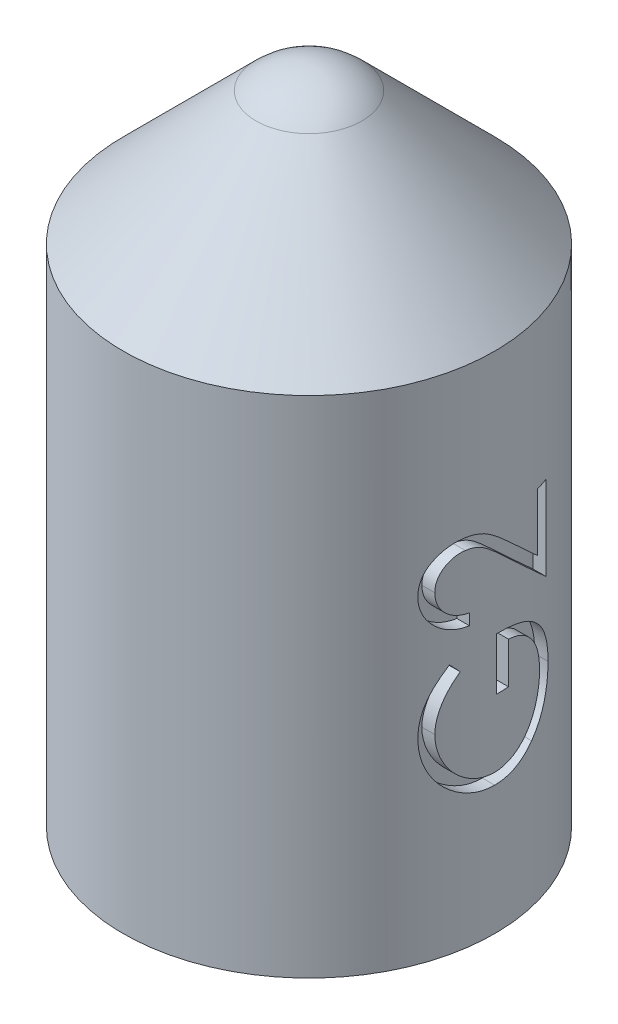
from build123d import *

# Parameters (mm, degrees)
ENL_V_MAT_EXTRU_1_REACH      = 8.442
ENL_V_MAT_EXTRU_1_END_RADIUS = 1.4
ENL_V_MAT_EXTRU_2_REACH      = 8.442
ENL_V_MAT_EXTRU_2_END_RADIUS = 1.4


with BuildPart() as part:
    # Esquisse1 → R_volution1 (revolve)
    with BuildSketch(Plane.XY):
        with BuildLine():
            Line((-1.5, 4.25), (-1.5, 0.17544468))
            ThreePointArc((-1.5, 0.17544468), (-0.755112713, 0.044010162), (0, 0))
            Line((0, 0), (0, 5.5))
            ThreePointArc((0, 5.5), (-0.230969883, 5.454057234), (-0.426776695, 5.323223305))
            Line((-0.426776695, 5.323223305), (-1.5, 4.25))
        make_face()
    revolve(axis=Axis((0, 0, 0), (0, 1, 0)))

    # Enl_v. mat.-Extru.1: up to this cylinder (the profile starts outside it)
    enl_v_mat_extru_1_end = Plane(origin=(0, 2.3089885, 0), z_dir=(0, -1, 0)) * Cylinder(ENL_V_MAT_EXTRU_1_END_RADIUS, 20.995511, mode=Mode.PRIVATE)
    # Esquisse2 → Enl_v. mat.-Extru.1 (cut, up to the surface)
    with BuildSketch(Plane(origin=(1.5, 0, 0), x_dir=(0, 0, -1), z_dir=(1, 0, 0)), mode=Mode.PRIVATE) as enl_v_mat_extru_1_sk1:
        with BuildLine():
            Line((-0.192307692, 2.509615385), (-0.192307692, 2.419871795))
            add(Edge.make_bspline(
                [(-0.192307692, 2.419871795), (-0.20421366, 2.420456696), (-0.227596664, 2.421605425), (-0.261689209, 2.426984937), (-0.294276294, 2.43468233), (-0.32509627, 2.445565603), (-0.354421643, 2.459081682), (-0.382135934, 2.475290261), (-0.408133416, 2.494488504), (-0.432173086, 2.516261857), (-0.454226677, 2.53991004), (-0.473271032, 2.565426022), (-0.489361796, 2.592238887), (-0.502813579, 2.620267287), (-0.512910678, 2.649827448), (-0.520402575, 2.680651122), (-0.524910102, 2.712873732), (-0.525394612, 2.734828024), (-0.525641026, 2.74599359)],
                knots=[0, 0, 0, 0, 1.10065271, 2.161652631, 3.183658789, 4.190468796, 5.17591951, 6.163126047, 7.15150782, 8.156236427, 9.156009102, 10.134482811, 11.092018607, 12.041330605, 13.001268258, 13.972401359, 14.968799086, 16, 16, 16, 16], degree=3))
            add(Edge.make_bspline(
                [(-0.525641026, 2.74599359), (-0.525386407, 2.756959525), (-0.52488609, 2.778507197), (-0.520524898, 2.809942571), (-0.51384176, 2.839939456), (-0.503938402, 2.868157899), (-0.491511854, 2.8948875), (-0.476057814, 2.919797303), (-0.458307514, 2.943489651), (-0.437370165, 2.964801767), (-0.415029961, 2.984379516), (-0.391170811, 3.001254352), (-0.366499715, 3.015787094), (-0.340823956, 3.027681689), (-0.314059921, 3.036698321), (-0.286464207, 3.043378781), (-0.257718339, 3.047197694), (-0.238258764, 3.04778058), (-0.228365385, 3.048076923)],
                knots=[0, 0, 0, 0, 1.111674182, 2.184400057, 3.212814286, 4.223731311, 5.211378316, 6.196328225, 7.191884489, 8.207283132, 9.220262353, 10.201199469, 11.166417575, 12.120932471, 13.06540007, 14.026332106, 14.996573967, 16, 16, 16, 16], degree=3))
            add(Edge.make_bspline(
                [(-0.228365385, 3.048076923), (-0.214437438, 3.047593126), (-0.18682596, 3.046634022), (-0.146250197, 3.038430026), (-0.106938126, 3.025616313), (-0.075297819, 3.010189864), (-0.049804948, 2.994623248), (-0.028805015, 2.980609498), (-0.006199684, 2.964110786), (0.018102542, 2.945268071), (0.043783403, 2.923756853), (0.071366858, 2.900135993), (0.100342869, 2.873795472), (0.120146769, 2.855324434), (0.130408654, 2.845753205)],
                knots=[0, 0, 0, 0, 1.184416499, 2.348048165, 3.509039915, 4.696071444, 5.333504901, 6.05069495, 6.844171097, 7.714965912, 8.667477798, 9.695072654, 10.805644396, 12, 12, 12, 12], degree=3))
            Line((0.130408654, 2.845753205), (0.397435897, 2.595552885))
            Line((0.397435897, 2.595552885), (0.397435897, 3.060897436))
            Line((0.397435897, 3.060897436), (0.5, 3.060897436))
            Line((0.5, 3.060897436), (0.5, 2.381410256))
            Line((0.5, 2.381410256), (0.086137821, 2.769230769))
            add(Edge.make_bspline(
                [(0.086137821, 2.769230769), (0.076281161, 2.778673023), (0.057348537, 2.796809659), (0.029707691, 2.822461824), (0.004064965, 2.845501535), (-0.019531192, 2.866077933), (-0.041425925, 2.883744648), (-0.060910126, 2.899422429), (-0.078839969, 2.911984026), (-0.099623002, 2.925616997), (-0.12499795, 2.938820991), (-0.156007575, 2.950167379), (-0.187929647, 2.957085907), (-0.209501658, 2.95791586), (-0.220352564, 2.958333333)],
                knots=[0, 0, 0, 0, 1.329631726, 2.553950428, 3.673215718, 4.687767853, 5.603093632, 6.413772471, 7.123043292, 7.734684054, 8.834405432, 9.900288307, 10.943827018, 12, 12, 12, 12], degree=3))
            add(Edge.make_bspline(
                [(-0.220352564, 2.958333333), (-0.227175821, 2.958151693), (-0.240623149, 2.957793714), (-0.260339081, 2.954634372), (-0.279357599, 2.949859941), (-0.297737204, 2.943018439), (-0.315293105, 2.933987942), (-0.332046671, 2.922995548), (-0.348243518, 2.910312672), (-0.363430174, 2.895640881), (-0.37733909, 2.879523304), (-0.389660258, 2.862496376), (-0.399957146, 2.84448206), (-0.408398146, 2.825556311), (-0.415019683, 2.805771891), (-0.419607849, 2.785090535), (-0.422488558, 2.763569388), (-0.422878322, 2.748874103), (-0.423076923, 2.741386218)],
                knots=[0, 0, 0, 0, 0.991446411, 1.95395049, 2.89581595, 3.838931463, 4.798493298, 5.75982156, 6.748411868, 7.785213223, 8.824556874, 9.840280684, 10.836137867, 11.835679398, 12.848801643, 13.863922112, 14.911575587, 16, 16, 16, 16], degree=3))
            add(Edge.make_bspline(
                [(-0.423076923, 2.741386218), (-0.422880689, 2.733564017), (-0.422495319, 2.718202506), (-0.419576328, 2.695696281), (-0.415151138, 2.674078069), (-0.40812297, 2.653670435), (-0.39981884, 2.634031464), (-0.389269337, 2.615580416), (-0.377010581, 2.598010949), (-0.362796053, 2.581612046), (-0.346825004, 2.566634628), (-0.329223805, 2.553289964), (-0.310119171, 2.541706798), (-0.289589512, 2.531586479), (-0.267430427, 2.523371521), (-0.243725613, 2.517093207), (-0.218576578, 2.512125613), (-0.201209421, 2.510466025), (-0.192307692, 2.509615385)],
                knots=[0, 0, 0, 0, 1.030878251, 2.024474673, 2.987898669, 3.934362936, 4.864849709, 5.795128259, 6.730474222, 7.685293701, 8.650606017, 9.611896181, 10.591709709, 11.591680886, 12.625074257, 13.701333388, 14.821793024, 16, 16, 16, 16], degree=3))
        make_face()
    enl_v_mat_extru_1_tool1 = extrude(enl_v_mat_extru_1_sk1.sketch, amount=-ENL_V_MAT_EXTRU_1_REACH, mode=Mode.PRIVATE) - enl_v_mat_extru_1_end
    add(enl_v_mat_extru_1_tool1.solids().sort_by_distance((1.5, 2.464744, 0.204611))[0], mode=Mode.SUBTRACT)
    # Esquisse2 → Enl_v. mat.-Extru.1 (cut, up to the surface)
    with BuildSketch(Plane(origin=(1.5, 0, 0), x_dir=(0, 0, -1), z_dir=(1, 0, 0)), mode=Mode.PRIVATE) as enl_v_mat_extru_1_sk2:
        with BuildLine():
            Line((-0.329326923, 2.201923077), (-0.256410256, 2.125))
            add(Edge.make_bspline(
                [(-0.256410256, 2.125), (-0.269509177, 2.11108312), (-0.295394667, 2.083581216), (-0.328926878, 2.038666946), (-0.357936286, 1.991993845), (-0.381363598, 1.943486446), (-0.399741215, 1.894416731), (-0.413100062, 1.845628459), (-0.421560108, 1.797437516), (-0.422576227, 1.765390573), (-0.423076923, 1.749599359)],
                knots=[0, 0, 0, 0, 1.089067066, 2.152164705, 3.18986567, 4.218445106, 5.218487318, 6.173592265, 7.100032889, 8, 8, 8, 8], degree=3))
            add(Edge.make_bspline(
                [(-0.423076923, 1.749599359), (-0.42295875, 1.739909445), (-0.42272271, 1.720554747), (-0.419710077, 1.691805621), (-0.415377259, 1.66335801), (-0.409108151, 1.635265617), (-0.401162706, 1.607473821), (-0.391224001, 1.580079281), (-0.379636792, 1.55303089), (-0.3662475, 1.526583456), (-0.351539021, 1.500943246), (-0.335239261, 1.476727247), (-0.317871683, 1.453779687), (-0.298997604, 1.432537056), (-0.278802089, 1.412858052), (-0.257648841, 1.394380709), (-0.235121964, 1.377449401), (-0.211314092, 1.36236779), (-0.186779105, 1.348748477), (-0.161725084, 1.336979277), (-0.136384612, 1.326747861), (-0.11056688, 1.318955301), (-0.084538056, 1.312355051), (-0.058161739, 1.307760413), (-0.031369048, 1.305161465), (-0.013426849, 1.304712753), (-0.004407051, 1.304487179)],
                knots=[0, 0, 0, 0, 1.028150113, 2.053633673, 3.06513288, 4.081487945, 5.106702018, 6.131327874, 7.172780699, 8.228344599, 9.276313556, 10.308389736, 11.324843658, 12.329040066, 13.321460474, 14.316307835, 15.308626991, 16.309440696, 17.305625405, 18.28535951, 19.246194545, 20.203493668, 21.145557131, 22.095268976, 23.042464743, 24, 24, 24, 24], degree=3))
            add(Edge.make_bspline(
                [(-0.004407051, 1.304487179), (0.004813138, 1.304703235), (0.023228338, 1.305134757), (0.050713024, 1.307892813), (0.077786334, 1.313022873), (0.104490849, 1.31982623), (0.130879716, 1.328475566), (0.156925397, 1.339101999), (0.18262536, 1.351760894), (0.207724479, 1.366381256), (0.232153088, 1.382526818), (0.255356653, 1.4002843), (0.277065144, 1.419683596), (0.297595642, 1.440369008), (0.316818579, 1.462529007), (0.334502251, 1.486378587), (0.350920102, 1.5115839), (0.365891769, 1.538156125), (0.379265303, 1.565814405), (0.391157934, 1.594173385), (0.400952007, 1.623324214), (0.408934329, 1.653113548), (0.415477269, 1.683505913), (0.41968655, 1.71465557), (0.422741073, 1.746333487), (0.422964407, 1.767687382), (0.423076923, 1.778445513)],
                knots=[0, 0, 0, 0, 0.935915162, 1.869274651, 2.799799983, 3.730201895, 4.664668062, 5.616159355, 6.583070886, 7.570012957, 8.562524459, 9.553461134, 10.53281078, 11.515274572, 12.509912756, 13.507571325, 14.526460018, 15.561318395, 16.601025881, 17.643204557, 18.680545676, 19.719612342, 20.772381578, 21.833430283, 22.908478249, 24, 24, 24, 24], degree=3))
            add(Edge.make_bspline(
                [(0.423076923, 1.778445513), (0.422806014, 1.791410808), (0.422274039, 1.816870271), (0.418129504, 1.854294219), (0.411664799, 1.890240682), (0.402167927, 1.924592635), (0.390147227, 1.957474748), (0.375281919, 1.988765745), (0.357728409, 2.018552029), (0.337842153, 2.046704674), (0.315685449, 2.072554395), (0.291989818, 2.096080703), (0.266448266, 2.116474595), (0.239441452, 2.134345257), (0.21071105, 2.149115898), (0.180416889, 2.161243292), (0.148540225, 2.170538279), (0.126514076, 2.174354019), (0.115384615, 2.176282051)],
                knots=[0, 0, 0, 0, 1.130199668, 2.219330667, 3.279027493, 4.311506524, 5.322739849, 6.327972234, 7.327472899, 8.33386792, 9.329086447, 10.29244429, 11.240784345, 12.174119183, 13.111530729, 14.052100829, 15.015757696, 16, 16, 16, 16], degree=3))
            Line((0.115384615, 2.176282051), (0.115384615, 1.842948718))
            Line((0.115384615, 1.842948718), (0.012820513, 1.842948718))
            Line((0.012820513, 1.842948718), (0.012820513, 2.266025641))
            add(Edge.make_bspline(
                [(0.012820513, 2.266025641), (0.031936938, 2.265538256), (0.069351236, 2.264584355), (0.12391417, 2.257893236), (0.17544894, 2.247088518), (0.224009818, 2.232328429), (0.269527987, 2.213221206), (0.312049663, 2.189971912), (0.351300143, 2.162208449), (0.387599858, 2.130919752), (0.419979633, 2.095805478), (0.448438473, 2.057814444), (0.472410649, 2.016883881), (0.491913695, 1.973052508), (0.507134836, 1.926463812), (0.517926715, 1.87700999), (0.524392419, 1.824758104), (0.525218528, 1.788947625), (0.525641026, 1.770633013)],
                knots=[0, 0, 0, 0, 1.140356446, 2.231883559, 3.274166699, 4.278491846, 5.25512956, 6.21435461, 7.1637429, 8.11826594, 9.068280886, 10.0076534, 10.945064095, 11.891975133, 12.864533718, 13.863980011, 14.907571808, 16, 16, 16, 16], degree=3))
            add(Edge.make_bspline(
                [(0.525641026, 1.770633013), (0.52547842, 1.759344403), (0.525157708, 1.737079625), (0.522878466, 1.704196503), (0.51936973, 1.67222004), (0.514071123, 1.641154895), (0.507581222, 1.610886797), (0.499270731, 1.581566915), (0.489651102, 1.553083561), (0.478709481, 1.525392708), (0.466031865, 1.498745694), (0.451943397, 1.473023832), (0.436516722, 1.448084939), (0.419485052, 1.424098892), (0.400975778, 1.400940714), (0.380951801, 1.378759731), (0.359474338, 1.357431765), (0.344223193, 1.344071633), (0.336538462, 1.337339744)],
                knots=[0, 0, 0, 0, 1.107784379, 2.184907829, 3.233506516, 4.263428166, 5.276301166, 6.270063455, 7.25232949, 8.225834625, 9.190232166, 10.146266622, 11.1027726, 12.066435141, 13.031522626, 14.010570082, 14.99756817, 16, 16, 16, 16], degree=3))
            add(Edge.make_bspline(
                [(0.336538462, 1.337339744), (0.324346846, 1.327572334), (0.300165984, 1.308199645), (0.261423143, 1.283263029), (0.221308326, 1.262005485), (0.179709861, 1.244757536), (0.136666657, 1.231289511), (0.092233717, 1.221630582), (0.046353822, 1.215971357), (0.015306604, 1.21515606), (-0.000400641, 1.21474359)],
                knots=[0, 0, 0, 0, 1.023165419, 2.029347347, 3.013907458, 3.994755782, 4.975994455, 5.96558838, 6.970761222, 8, 8, 8, 8], degree=3))
            add(Edge.make_bspline(
                [(-0.000400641, 1.21474359), (-0.012162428, 1.214895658), (-0.035536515, 1.215197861), (-0.070238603, 1.218862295), (-0.104324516, 1.224119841), (-0.137766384, 1.231847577), (-0.170586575, 1.241589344), (-0.202800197, 1.253747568), (-0.234426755, 1.267902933), (-0.265246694, 1.284357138), (-0.294858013, 1.302662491), (-0.323115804, 1.322550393), (-0.349562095, 1.344174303), (-0.374258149, 1.367597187), (-0.397569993, 1.392346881), (-0.419010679, 1.418942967), (-0.438915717, 1.446982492), (-0.456902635, 1.476682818), (-0.473064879, 1.507575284), (-0.487232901, 1.539592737), (-0.498942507, 1.572723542), (-0.508877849, 1.606719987), (-0.516225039, 1.641839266), (-0.52155325, 1.677826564), (-0.525199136, 1.714869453), (-0.525492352, 1.739908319), (-0.525641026, 1.752604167)],
                knots=[0, 0, 0, 0, 1.00895651, 2.005089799, 2.991467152, 3.967318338, 4.948153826, 5.927364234, 6.919980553, 7.91976625, 8.923240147, 9.905815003, 10.88314567, 11.851989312, 12.825009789, 13.798721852, 14.781296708, 15.773896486, 16.776076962, 17.771600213, 18.775744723, 19.78957137, 20.808953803, 21.851964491, 22.910847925, 24, 24, 24, 24], degree=3))
            add(Edge.make_bspline(
                [(-0.525641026, 1.752604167), (-0.525475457, 1.762957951), (-0.525147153, 1.783488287), (-0.522871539, 1.814038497), (-0.519264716, 1.844116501), (-0.514342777, 1.873766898), (-0.507638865, 1.902888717), (-0.499616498, 1.931564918), (-0.490275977, 1.959837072), (-0.479136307, 1.987616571), (-0.466492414, 2.015090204), (-0.452260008, 2.04241073), (-0.436195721, 2.069484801), (-0.418251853, 2.096359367), (-0.398736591, 2.123203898), (-0.377091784, 2.149593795), (-0.354170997, 2.176166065), (-0.337690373, 2.193252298), (-0.329326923, 2.201923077)],
                knots=[0, 0, 0, 0, 0.985871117, 1.954866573, 2.915460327, 3.869826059, 4.81536089, 5.759505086, 6.70452669, 7.649098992, 8.607881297, 9.583363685, 10.581137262, 11.603961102, 12.659522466, 13.73993555, 14.853081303, 16, 16, 16, 16], degree=3))
        make_face()
    enl_v_mat_extru_1_tool2 = extrude(enl_v_mat_extru_1_sk2.sketch, amount=-ENL_V_MAT_EXTRU_1_REACH, mode=Mode.PRIVATE) - enl_v_mat_extru_1_end
    add(enl_v_mat_extru_1_tool2.solids().sort_by_distance((1.5, 2.153233, 0.303659))[0], mode=Mode.SUBTRACT)

    # Enl_v. mat.-Extru.2: up to this cylinder (the profile starts outside it)
    enl_v_mat_extru_2_end = Plane(origin=(0, 2.30883, 0), z_dir=(0, -1, 0)) * Cylinder(ENL_V_MAT_EXTRU_2_END_RADIUS, 20.99551, mode=Mode.PRIVATE)
    # Esquisse3 → Enl_v. mat.-Extru.2 (cut, up to the surface)
    with BuildSketch(Plane.ZY.offset(1.5), mode=Mode.PRIVATE) as enl_v_mat_extru_2_sk1:
        with BuildLine():
            Line((-0.192307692, 2.509456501), (-0.192307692, 2.419712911))
            add(Edge.make_bspline(
                [(-0.192307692, 2.419712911), (-0.20421366, 2.420297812), (-0.227596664, 2.421446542), (-0.261689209, 2.426826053), (-0.294276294, 2.434523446), (-0.32509627, 2.445406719), (-0.354421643, 2.458922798), (-0.382135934, 2.475131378), (-0.408133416, 2.494329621), (-0.432173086, 2.516102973), (-0.454226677, 2.539751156), (-0.473271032, 2.565267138), (-0.489361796, 2.592080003), (-0.502813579, 2.620108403), (-0.512910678, 2.649668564), (-0.520402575, 2.680492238), (-0.524910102, 2.712714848), (-0.525394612, 2.73466914), (-0.525641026, 2.745834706)],
                knots=[0, 0, 0, 0, 1.10065271, 2.161652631, 3.183658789, 4.190468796, 5.17591951, 6.163126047, 7.15150782, 8.156236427, 9.156009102, 10.134482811, 11.092018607, 12.041330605, 13.001268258, 13.972401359, 14.968799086, 16, 16, 16, 16], degree=3))
            add(Edge.make_bspline(
                [(-0.525641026, 2.745834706), (-0.525386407, 2.756800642), (-0.52488609, 2.778348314), (-0.520524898, 2.809783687), (-0.51384176, 2.839780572), (-0.503938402, 2.867999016), (-0.491511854, 2.894728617), (-0.476057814, 2.919638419), (-0.458307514, 2.943330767), (-0.437370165, 2.964642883), (-0.415029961, 2.984220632), (-0.391170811, 3.001095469), (-0.366499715, 3.01562821), (-0.340823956, 3.027522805), (-0.314059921, 3.036539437), (-0.286464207, 3.043219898), (-0.257718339, 3.04703881), (-0.238258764, 3.047621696), (-0.228365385, 3.047918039)],
                knots=[0, 0, 0, 0, 1.111674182, 2.184400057, 3.212814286, 4.223731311, 5.211378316, 6.196328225, 7.191884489, 8.207283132, 9.220262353, 10.201199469, 11.166417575, 12.120932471, 13.06540007, 14.026332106, 14.996573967, 16, 16, 16, 16], degree=3))
            add(Edge.make_bspline(
                [(-0.228365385, 3.047918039), (-0.214437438, 3.047434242), (-0.18682596, 3.046475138), (-0.146250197, 3.038271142), (-0.106938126, 3.025457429), (-0.075297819, 3.01003098), (-0.049804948, 2.994464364), (-0.028805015, 2.980450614), (-0.006199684, 2.963951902), (0.018102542, 2.945109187), (0.043783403, 2.92359797), (0.071366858, 2.899977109), (0.100342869, 2.873636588), (0.120146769, 2.85516555), (0.130408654, 2.845594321)],
                knots=[0, 0, 0, 0, 1.184416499, 2.348048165, 3.509039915, 4.696071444, 5.333504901, 6.05069495, 6.844171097, 7.714965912, 8.667477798, 9.695072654, 10.805644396, 12, 12, 12, 12], degree=3))
            Line((0.130408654, 2.845594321), (0.397435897, 2.595394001))
            Line((0.397435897, 2.595394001), (0.397435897, 3.060738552))
            Line((0.397435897, 3.060738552), (0.5, 3.060738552))
            Line((0.5, 3.060738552), (0.5, 2.381251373))
            Line((0.5, 2.381251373), (0.086137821, 2.769071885))
            add(Edge.make_bspline(
                [(0.086137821, 2.769071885), (0.076281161, 2.778514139), (0.057348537, 2.796650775), (0.029707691, 2.82230294), (0.004064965, 2.845342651), (-0.019531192, 2.865919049), (-0.041425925, 2.883585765), (-0.060910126, 2.899263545), (-0.078839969, 2.911825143), (-0.099623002, 2.925458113), (-0.12499795, 2.938662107), (-0.156007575, 2.950008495), (-0.187929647, 2.956927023), (-0.209501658, 2.957756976), (-0.220352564, 2.95817445)],
                knots=[0, 0, 0, 0, 1.329631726, 2.553950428, 3.673215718, 4.687767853, 5.603093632, 6.413772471, 7.123043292, 7.734684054, 8.834405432, 9.900288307, 10.943827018, 12, 12, 12, 12], degree=3))
            add(Edge.make_bspline(
                [(-0.220352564, 2.95817445), (-0.227175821, 2.957992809), (-0.240623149, 2.95763483), (-0.260339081, 2.954475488), (-0.279357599, 2.949701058), (-0.297737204, 2.942859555), (-0.315293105, 2.933829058), (-0.332046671, 2.922836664), (-0.348243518, 2.910153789), (-0.363430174, 2.895481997), (-0.37733909, 2.87936442), (-0.389660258, 2.862337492), (-0.399957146, 2.844323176), (-0.408398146, 2.825397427), (-0.415019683, 2.805613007), (-0.419607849, 2.784931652), (-0.422488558, 2.763410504), (-0.422878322, 2.74871522), (-0.423076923, 2.741227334)],
                knots=[0, 0, 0, 0, 0.991446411, 1.95395049, 2.89581595, 3.838931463, 4.798493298, 5.75982156, 6.748411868, 7.785213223, 8.824556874, 9.840280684, 10.836137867, 11.835679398, 12.848801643, 13.863922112, 14.911575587, 16, 16, 16, 16], degree=3))
            add(Edge.make_bspline(
                [(-0.423076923, 2.741227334), (-0.422880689, 2.733405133), (-0.422495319, 2.718043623), (-0.419576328, 2.695537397), (-0.415151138, 2.673919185), (-0.40812297, 2.653511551), (-0.39981884, 2.63387258), (-0.389269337, 2.615421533), (-0.377010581, 2.597852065), (-0.362796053, 2.581453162), (-0.346825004, 2.566475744), (-0.329223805, 2.553131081), (-0.310119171, 2.541547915), (-0.289589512, 2.531427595), (-0.267430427, 2.523212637), (-0.243725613, 2.516934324), (-0.218576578, 2.511966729), (-0.201209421, 2.510307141), (-0.192307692, 2.509456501)],
                knots=[0, 0, 0, 0, 1.030878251, 2.024474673, 2.987898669, 3.934362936, 4.864849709, 5.795128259, 6.730474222, 7.685293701, 8.650606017, 9.611896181, 10.591709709, 11.591680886, 12.625074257, 13.701333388, 14.821793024, 16, 16, 16, 16], degree=3))
        make_face()
    enl_v_mat_extru_2_tool1 = extrude(enl_v_mat_extru_2_sk1.sketch, amount=-ENL_V_MAT_EXTRU_2_REACH, mode=Mode.PRIVATE) - enl_v_mat_extru_2_end
    add(enl_v_mat_extru_2_tool1.solids().sort_by_distance((-1.5, 2.464585, -0.204611))[0], mode=Mode.SUBTRACT)
    # Esquisse3 → Enl_v. mat.-Extru.2 (cut, up to the surface)
    with BuildSketch(Plane.ZY.offset(1.5), mode=Mode.PRIVATE) as enl_v_mat_extru_2_sk2:
        with BuildLine():
            Line((-0.329326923, 2.201764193), (-0.256410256, 2.124841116))
            add(Edge.make_bspline(
                [(-0.256410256, 2.124841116), (-0.269509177, 2.110924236), (-0.295394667, 2.083422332), (-0.328926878, 2.038508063), (-0.357936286, 1.991834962), (-0.381363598, 1.943327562), (-0.399741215, 1.894257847), (-0.413100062, 1.845469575), (-0.421560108, 1.797278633), (-0.422576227, 1.765231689), (-0.423076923, 1.749440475)],
                knots=[0, 0, 0, 0, 1.089067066, 2.152164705, 3.18986567, 4.218445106, 5.218487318, 6.173592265, 7.100032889, 8, 8, 8, 8], degree=3))
            add(Edge.make_bspline(
                [(-0.423076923, 1.749440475), (-0.42295875, 1.739750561), (-0.42272271, 1.720395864), (-0.419710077, 1.691646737), (-0.415377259, 1.663199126), (-0.409108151, 1.635106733), (-0.401162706, 1.607314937), (-0.391224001, 1.579920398), (-0.379636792, 1.552872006), (-0.3662475, 1.526424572), (-0.351539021, 1.500784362), (-0.335239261, 1.476568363), (-0.317871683, 1.453620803), (-0.298997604, 1.432378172), (-0.278802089, 1.412699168), (-0.257648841, 1.394221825), (-0.235121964, 1.377290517), (-0.211314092, 1.362208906), (-0.186779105, 1.348589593), (-0.161725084, 1.336820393), (-0.136384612, 1.326588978), (-0.11056688, 1.318796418), (-0.084538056, 1.312196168), (-0.058161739, 1.307601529), (-0.031369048, 1.305002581), (-0.013426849, 1.304553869), (-0.004407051, 1.304328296)],
                knots=[0, 0, 0, 0, 1.028150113, 2.053633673, 3.06513288, 4.081487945, 5.106702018, 6.131327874, 7.172780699, 8.228344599, 9.276313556, 10.308389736, 11.324843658, 12.329040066, 13.321460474, 14.316307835, 15.308626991, 16.309440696, 17.305625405, 18.28535951, 19.246194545, 20.203493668, 21.145557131, 22.095268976, 23.042464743, 24, 24, 24, 24], degree=3))
            add(Edge.make_bspline(
                [(-0.004407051, 1.304328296), (0.004813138, 1.304544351), (0.023228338, 1.304975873), (0.050713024, 1.307733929), (0.077786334, 1.312863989), (0.104490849, 1.319667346), (0.130879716, 1.328316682), (0.156925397, 1.338943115), (0.18262536, 1.35160201), (0.207724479, 1.366222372), (0.232153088, 1.382367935), (0.255356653, 1.400125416), (0.277065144, 1.419524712), (0.297595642, 1.440210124), (0.316818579, 1.462370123), (0.334502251, 1.486219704), (0.350920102, 1.511425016), (0.365891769, 1.537997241), (0.379265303, 1.565655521), (0.391157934, 1.594014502), (0.400952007, 1.623165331), (0.408934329, 1.652954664), (0.415477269, 1.683347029), (0.41968655, 1.714496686), (0.422741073, 1.746174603), (0.422964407, 1.767528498), (0.423076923, 1.778286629)],
                knots=[0, 0, 0, 0, 0.935915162, 1.869274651, 2.799799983, 3.730201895, 4.664668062, 5.616159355, 6.583070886, 7.570012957, 8.562524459, 9.553461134, 10.53281078, 11.515274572, 12.509912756, 13.507571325, 14.526460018, 15.561318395, 16.601025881, 17.643204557, 18.680545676, 19.719612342, 20.772381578, 21.833430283, 22.908478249, 24, 24, 24, 24], degree=3))
            add(Edge.make_bspline(
                [(0.423076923, 1.778286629), (0.422806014, 1.791251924), (0.422274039, 1.816711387), (0.418129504, 1.854135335), (0.411664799, 1.890081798), (0.402167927, 1.924433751), (0.390147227, 1.957315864), (0.375281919, 1.988606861), (0.357728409, 2.018393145), (0.337842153, 2.046545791), (0.315685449, 2.072395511), (0.291989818, 2.095921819), (0.266448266, 2.116315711), (0.239441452, 2.134186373), (0.21071105, 2.148957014), (0.180416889, 2.161084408), (0.148540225, 2.170379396), (0.126514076, 2.174195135), (0.115384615, 2.176123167)],
                knots=[0, 0, 0, 0, 1.130199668, 2.219330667, 3.279027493, 4.311506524, 5.322739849, 6.327972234, 7.327472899, 8.33386792, 9.329086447, 10.29244429, 11.240784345, 12.174119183, 13.111530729, 14.052100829, 15.015757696, 16, 16, 16, 16], degree=3))
            Line((0.115384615, 2.176123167), (0.115384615, 1.842789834))
            Line((0.115384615, 1.842789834), (0.012820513, 1.842789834))
            Line((0.012820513, 1.842789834), (0.012820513, 2.265866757))
            add(Edge.make_bspline(
                [(0.012820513, 2.265866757), (0.031936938, 2.265379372), (0.069351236, 2.264425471), (0.12391417, 2.257734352), (0.17544894, 2.246929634), (0.224009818, 2.232169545), (0.269527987, 2.213062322), (0.312049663, 2.189813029), (0.351300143, 2.162049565), (0.387599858, 2.130760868), (0.419979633, 2.095646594), (0.448438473, 2.05765556), (0.472410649, 2.016724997), (0.491913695, 1.972893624), (0.507134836, 1.926304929), (0.517926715, 1.876851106), (0.524392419, 1.82459922), (0.525218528, 1.788788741), (0.525641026, 1.770474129)],
                knots=[0, 0, 0, 0, 1.140356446, 2.231883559, 3.274166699, 4.278491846, 5.25512956, 6.21435461, 7.1637429, 8.11826594, 9.068280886, 10.0076534, 10.945064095, 11.891975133, 12.864533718, 13.863980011, 14.907571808, 16, 16, 16, 16], degree=3))
            add(Edge.make_bspline(
                [(0.525641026, 1.770474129), (0.52547842, 1.759185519), (0.525157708, 1.736920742), (0.522878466, 1.704037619), (0.51936973, 1.672061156), (0.514071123, 1.640996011), (0.507581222, 1.610727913), (0.499270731, 1.581408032), (0.489651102, 1.552924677), (0.478709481, 1.525233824), (0.466031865, 1.49858681), (0.451943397, 1.472864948), (0.436516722, 1.447926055), (0.419485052, 1.423940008), (0.400975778, 1.400781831), (0.380951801, 1.378600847), (0.359474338, 1.357272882), (0.344223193, 1.343912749), (0.336538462, 1.33718086)],
                knots=[0, 0, 0, 0, 1.107784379, 2.184907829, 3.233506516, 4.263428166, 5.276301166, 6.270063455, 7.25232949, 8.225834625, 9.190232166, 10.146266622, 11.1027726, 12.066435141, 13.031522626, 14.010570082, 14.99756817, 16, 16, 16, 16], degree=3))
            add(Edge.make_bspline(
                [(0.336538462, 1.33718086), (0.324346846, 1.327413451), (0.300165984, 1.308040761), (0.261423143, 1.283104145), (0.221308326, 1.261846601), (0.179709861, 1.244598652), (0.136666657, 1.231130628), (0.092233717, 1.221471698), (0.046353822, 1.215812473), (0.015306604, 1.214997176), (-0.000400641, 1.214584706)],
                knots=[0, 0, 0, 0, 1.023165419, 2.029347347, 3.013907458, 3.994755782, 4.975994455, 5.96558838, 6.970761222, 8, 8, 8, 8], degree=3))
            add(Edge.make_bspline(
                [(-0.000400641, 1.214584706), (-0.012162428, 1.214736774), (-0.035536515, 1.215038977), (-0.070238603, 1.218703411), (-0.104324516, 1.223960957), (-0.137766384, 1.231688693), (-0.170586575, 1.241430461), (-0.202800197, 1.253588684), (-0.234426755, 1.267744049), (-0.265246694, 1.284198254), (-0.294858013, 1.302503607), (-0.323115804, 1.322391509), (-0.349562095, 1.344015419), (-0.374258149, 1.367438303), (-0.397569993, 1.392187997), (-0.419010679, 1.418784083), (-0.438915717, 1.446823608), (-0.456902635, 1.476523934), (-0.473064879, 1.5074164), (-0.487232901, 1.539433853), (-0.498942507, 1.572564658), (-0.508877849, 1.606561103), (-0.516225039, 1.641680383), (-0.52155325, 1.677667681), (-0.525199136, 1.714710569), (-0.525492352, 1.739749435), (-0.525641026, 1.752445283)],
                knots=[0, 0, 0, 0, 1.00895651, 2.005089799, 2.991467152, 3.967318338, 4.948153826, 5.927364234, 6.919980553, 7.91976625, 8.923240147, 9.905815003, 10.88314567, 11.851989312, 12.825009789, 13.798721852, 14.781296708, 15.773896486, 16.776076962, 17.771600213, 18.775744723, 19.78957137, 20.808953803, 21.851964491, 22.910847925, 24, 24, 24, 24], degree=3))
            add(Edge.make_bspline(
                [(-0.525641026, 1.752445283), (-0.525475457, 1.762799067), (-0.525147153, 1.783329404), (-0.522871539, 1.813879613), (-0.519264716, 1.843957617), (-0.514342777, 1.873608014), (-0.507638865, 1.902729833), (-0.499616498, 1.931406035), (-0.490275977, 1.959678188), (-0.479136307, 1.987457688), (-0.466492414, 2.014931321), (-0.452260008, 2.042251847), (-0.436195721, 2.069325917), (-0.418251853, 2.096200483), (-0.398736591, 2.123045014), (-0.377091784, 2.149434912), (-0.354170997, 2.176007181), (-0.337690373, 2.193093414), (-0.329326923, 2.201764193)],
                knots=[0, 0, 0, 0, 0.985871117, 1.954866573, 2.915460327, 3.869826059, 4.81536089, 5.759505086, 6.70452669, 7.649098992, 8.607881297, 9.583363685, 10.581137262, 11.603961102, 12.659522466, 13.73993555, 14.853081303, 16, 16, 16, 16], degree=3))
        make_face()
    enl_v_mat_extru_2_tool2 = extrude(enl_v_mat_extru_2_sk2.sketch, amount=-ENL_V_MAT_EXTRU_2_REACH, mode=Mode.PRIVATE) - enl_v_mat_extru_2_end
    add(enl_v_mat_extru_2_tool2.solids().sort_by_distance((-1.5, 2.153075, -0.303659))[0], mode=Mode.SUBTRACT)


solid = part.part
